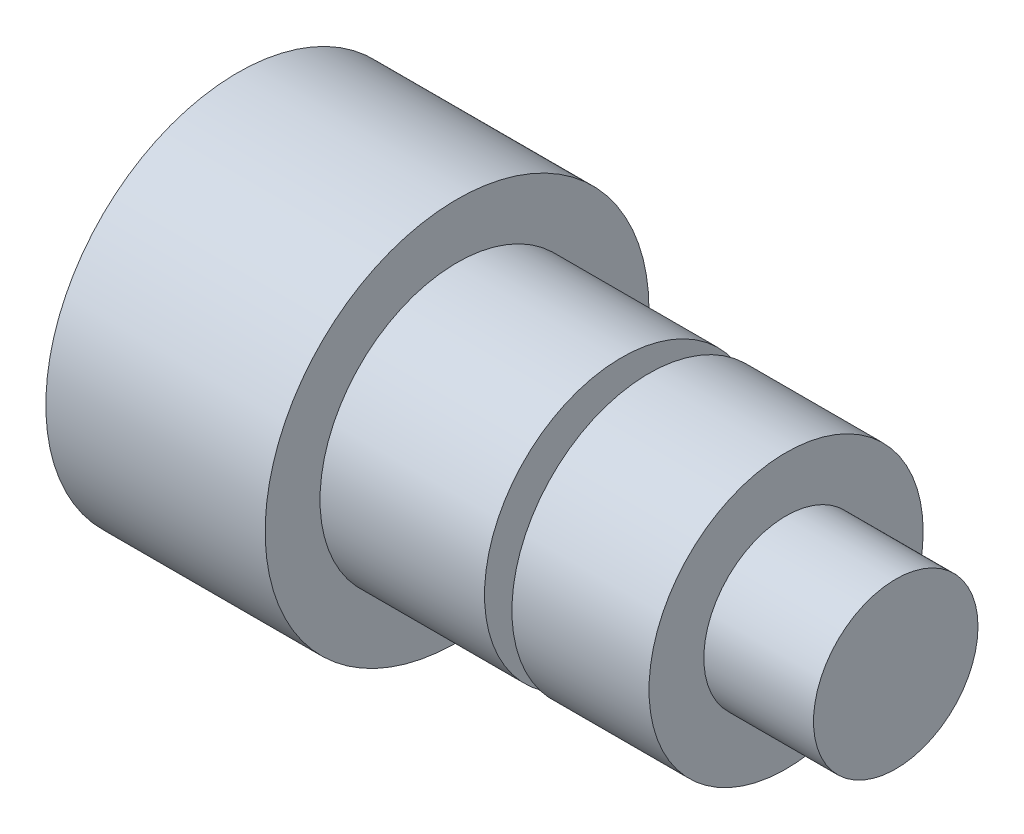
from build123d import *


with BuildPart() as part:
    # Sketch1 → Base-Revolve (revolve)
    with BuildSketch(Plane.XY, mode=Mode.PRIVATE) as base_revolve_sk:
        Polygon((0, 0), (0, 44.45), (50.8, 44.45), (50.8, 31.75), (88.9, 31.75), (88.9, 22.225), (95.25, 22.225), (95.25, 31.75), (127, 31.75), (127, 19.05), (152.4, 19.05), (152.4, 0), align=None)
    revolve(base_revolve_sk.sketch.rotate(Axis((213.782929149, 0, 0), (-1, 0, 0)), 90), axis=Axis((213.782929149, 0, 0), (-1, 0, 0)))


solid = part.part
